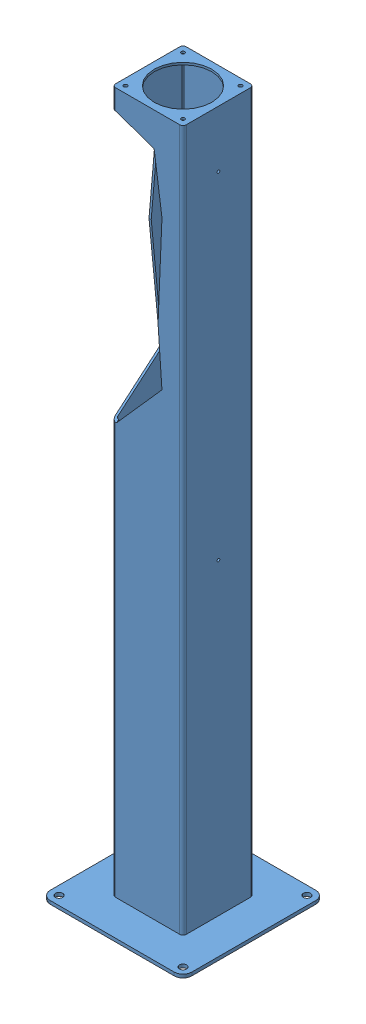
SolidWorks assembly KVM2-PED in PED4X4.SLDASM, configuration Default (file format 10000). Lengths in mm.
Overall size (203.2 1010.62 203.2).
2 component instances, 2 part files, 2 mates.
Components (placement in the parent):
- 4X4 Pedestal for Yoke Mounts and Enclosures, PED4X4-xxx-40-H4-1: 4X4 Pedestal for Yoke Mounts and Enclosures, PED4X4-xxx-40-H4.SLDPRT [With Cut Away] at (0.4916 -488.5816 -11.6228) size (203.2 1010.62 203.2)
- KVM2-PED-xxx-1: KVM2-PED-xxx.SLDPRT [Default] at (48.1166 459.8036 -11.6228) x (0 0 1) z (-1 0 0) size (76.2 556.26 37.08)
Mates (geometry in assembly coordinates):
- Coincident1: coincident anti-aligned: plane of 4X4 Pedestal for Yoke Mounts and Enclosures, PED4X4-xxx-40-H4-1 through (48.1166 522.0336 -57.5968) normal (-1 0 0); plane of KVM2-PED-xxx-1 through (48.1166 459.8036 -11.6228) normal (1 0 0)
- Concentric1: concentric aligned: cylinder of 4X4 Pedestal for Yoke Mounts and Enclosures, PED4X4-xxx-40-H4-1 through (51.2916 440.7536 -11.6228) axis (1 0 0) radius 2.0193; cylinder of KVM2-PED-xxx-1 through (48.1166 440.7536 -11.6228) axis (1 0 0) radius 1.3526
